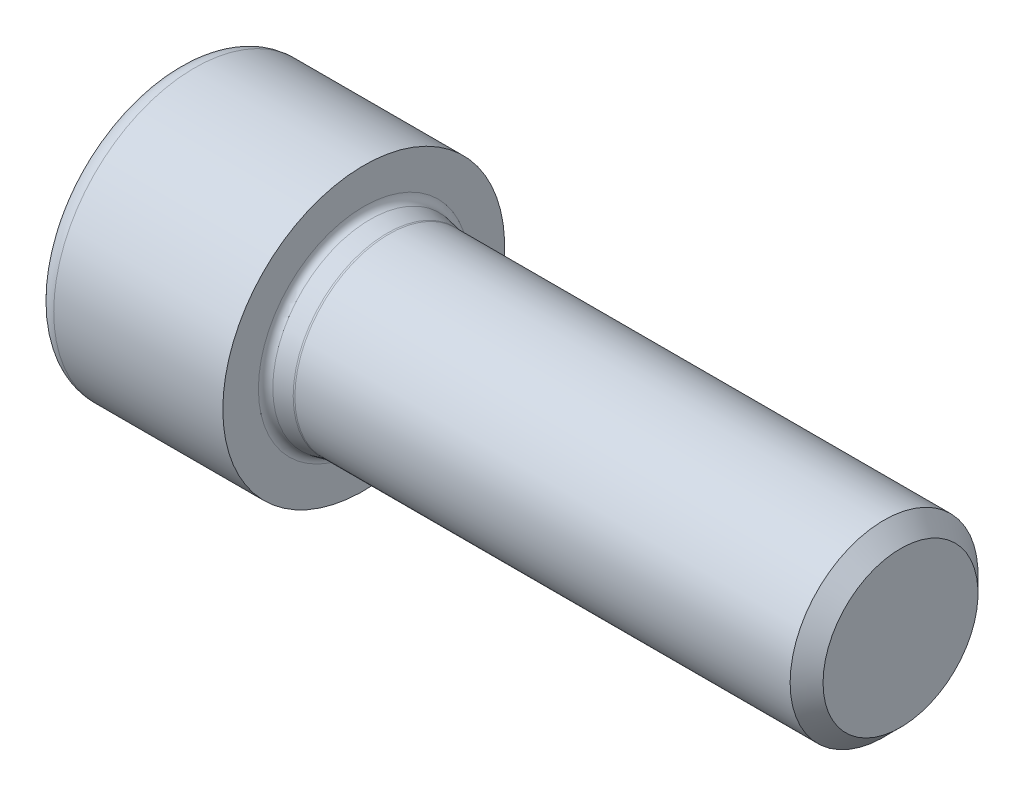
ISO-10303-21;
HEADER;
FILE_DESCRIPTION(('STEP AP214'),'2;1');
FILE_NAME('part.step','',(''),(''),'','','');
FILE_SCHEMA(('AUTOMOTIVE_DESIGN { 1 0 10303 214 1 1 1 1 }'));
ENDSEC;
DATA;
#1=APPLICATION_CONTEXT('core data for automotive mechanical design processes');
#2=APPLICATION_PROTOCOL_DEFINITION('international standard','automotive_design',2000,#1);
#3=PRODUCT_CONTEXT('',#1,'mechanical');
#4=PRODUCT('Part','Part','',(#3));
#5=PRODUCT_RELATED_PRODUCT_CATEGORY('part','',(#4));
#6=PRODUCT_DEFINITION_FORMATION('','',#4);
#7=PRODUCT_DEFINITION_CONTEXT('part definition',#1,'design');
#8=PRODUCT_DEFINITION('design','',#6,#7);
#9=PRODUCT_DEFINITION_SHAPE('','',#8);
#10=(LENGTH_UNIT() NAMED_UNIT(*) SI_UNIT(.MILLI.,.METRE.));
#11=(NAMED_UNIT(*) PLANE_ANGLE_UNIT() SI_UNIT($,.RADIAN.));
#12=(NAMED_UNIT(*) SI_UNIT($,.STERADIAN.) SOLID_ANGLE_UNIT());
#13=UNCERTAINTY_MEASURE_WITH_UNIT(LENGTH_MEASURE(1.E-05),#10,'distance_accuracy_value','');
#14=(GEOMETRIC_REPRESENTATION_CONTEXT(3) GLOBAL_UNCERTAINTY_ASSIGNED_CONTEXT((#13)) GLOBAL_UNIT_ASSIGNED_CONTEXT((#10,
#11,#12)) REPRESENTATION_CONTEXT('',''));
#15=CARTESIAN_POINT('',(0.,0.,0.));
#16=DIRECTION('',(0.,0.,1.));
#17=DIRECTION('',(1.,0.,0.));
#18=AXIS2_PLACEMENT_3D('',#15,#16,#17);
#19=CARTESIAN_POINT('',(-14.,0.,0.));
#20=DIRECTION('',(-1.,0.,0.));
#21=DIRECTION('',(0.,0.,1.));
#22=AXIS2_PLACEMENT_3D('',#19,#20,#21);
#23=CONICAL_SURFACE('',#22,6.86,0.785398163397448);
#24=CARTESIAN_POINT('',(-14.,0.,0.));
#25=DIRECTION('',(-1.,0.,0.));
#26=DIRECTION('',(0.,0.,1.));
#27=AXIS2_PLACEMENT_3D('',#24,#25,#26);
#28=CIRCLE('',#27,6.86);
#29=CARTESIAN_POINT('',(-14.,3.53335357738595,5.88005208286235));
#30=VERTEX_POINT('',#29);
#31=CARTESIAN_POINT('',(-14.,6.85895126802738,0.119947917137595));
#32=VERTEX_POINT('',#31);
#33=EDGE_CURVE('E282',#30,#32,#28,.T.);
#34=ORIENTED_EDGE('',*,*,#33,.T.);
#35=CARTESIAN_POINT('',(-14.0002,6.85915753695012,0.119590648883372));
#36=CARTESIAN_POINT('',(-13.9444024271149,6.80160595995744,0.219272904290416));
#37=CARTESIAN_POINT('',(-13.8903859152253,6.74362198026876,0.319704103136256));
#38=CARTESIAN_POINT('',(-13.7864300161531,6.62671397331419,0.522194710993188));
#39=CARTESIAN_POINT('',(-13.7364927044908,6.567789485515,0.624254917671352));
#40=CARTESIAN_POINT('',(-13.5932008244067,6.389013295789,0.933904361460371));
#41=CARTESIAN_POINT('',(-13.5069097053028,6.26770751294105,1.14401214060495));
#42=CARTESIAN_POINT('',(-13.3595054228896,6.02314041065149,1.56761478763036));
#43=CARTESIAN_POINT('',(-13.2980459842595,5.89993279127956,1.78101664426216));
#44=CARTESIAN_POINT('',(-13.2272474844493,5.71324359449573,2.10437181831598));
#45=CARTESIAN_POINT('',(-13.2072211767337,5.65075562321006,2.21260415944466));
#46=CARTESIAN_POINT('',(-13.1747219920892,5.52529479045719,2.42990869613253));
#47=CARTESIAN_POINT('',(-13.1622481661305,5.46232199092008,2.53898078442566));
#48=CARTESIAN_POINT('',(-13.1410701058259,5.30544059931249,2.81070732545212));
#49=CARTESIAN_POINT('',(-13.1371379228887,5.21135926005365,2.97366098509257));
#50=CARTESIAN_POINT('',(-13.1469976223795,5.02340970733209,3.29919915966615));
#51=CARTESIAN_POINT('',(-13.1607954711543,4.92954157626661,3.4617835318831));
#52=CARTESIAN_POINT('',(-13.2053017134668,4.74273805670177,3.7853367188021));
#53=CARTESIAN_POINT('',(-13.2360262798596,4.64980364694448,3.94630383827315));
#54=CARTESIAN_POINT('',(-13.3127309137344,4.46555140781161,4.26543807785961));
#55=CARTESIAN_POINT('',(-13.358709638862,4.37423343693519,4.42360544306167));
#56=CARTESIAN_POINT('',(-13.4489315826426,4.21917028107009,4.692182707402));
#57=CARTESIAN_POINT('',(-13.4899700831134,4.15494895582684,4.80341730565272));
#58=CARTESIAN_POINT('',(-13.578032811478,4.02754718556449,5.02408364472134));
#59=CARTESIAN_POINT('',(-13.6250566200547,3.96436666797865,5.1335155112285));
#60=CARTESIAN_POINT('',(-13.7241876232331,3.83925390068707,5.35021718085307));
#61=CARTESIAN_POINT('',(-13.7762779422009,3.77731828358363,5.45749281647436));
#62=CARTESIAN_POINT('',(-13.8849961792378,3.65447574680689,5.67026233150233));
#63=CARTESIAN_POINT('',(-13.9416224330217,3.59356845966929,5.77575684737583));
#64=CARTESIAN_POINT('',(-14.0002000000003,3.53314730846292,5.88040935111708));
#65=B_SPLINE_CURVE_WITH_KNOTS('',3,(#35,#36,#37,#38,#39,#40,#41,#42,#43,#44,#45,#46,#47,#48,#49,
#50,#51,#52,#53,#54,#55,#56,#57,#58,#59,#60,#61,#62,#63,#64),.UNSPECIFIED.,.F.,.F.,(4,2,2,2,2,2,
2,2,2,2,2,2,2,2,4),(0.,0.383720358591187,0.767634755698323,1.539127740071,2.29945660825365,
2.67896671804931,3.05842912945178,3.62216130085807,4.18608322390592,4.75054489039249,
5.31495689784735,5.71932747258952,6.12366973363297,6.52670854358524,6.92960014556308),.UNSPECIFIED.);
#66=EDGE_CURVE('E247',#32,#30,#65,.T.);
#67=ORIENTED_EDGE('',*,*,#66,.T.);
#68=EDGE_LOOP('',(#34,#67));
#69=FACE_BOUND('',#68,.T.);
#70=ADVANCED_FACE('F37',(#69),#23,.F.);
#71=CARTESIAN_POINT('',(-14.,6.85895126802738,-0.119947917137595));
#72=VERTEX_POINT('',#71);
#73=CARTESIAN_POINT('',(-14.,3.53335357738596,-5.88005208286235));
#74=VERTEX_POINT('',#73);
#75=EDGE_CURVE('E285',#72,#74,#28,.T.);
#76=ORIENTED_EDGE('',*,*,#75,.T.);
#77=CARTESIAN_POINT('',(-14.0002000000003,3.53314730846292,-5.88040935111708));
#78=CARTESIAN_POINT('',(-13.9444024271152,3.59069888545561,-5.78072709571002));
#79=CARTESIAN_POINT('',(-13.8903859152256,3.6486828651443,-5.68029589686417));
#80=CARTESIAN_POINT('',(-13.7864300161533,3.76559087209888,-5.47780528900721));
#81=CARTESIAN_POINT('',(-13.736492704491,3.82451535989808,-5.37574508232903));
#82=CARTESIAN_POINT('',(-13.5932008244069,4.00329154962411,-5.06609563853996));
#83=CARTESIAN_POINT('',(-13.5069097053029,4.12459733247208,-4.85598785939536));
#84=CARTESIAN_POINT('',(-13.3595054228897,4.36916443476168,-4.43238521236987));
#85=CARTESIAN_POINT('',(-13.2980459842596,4.49237205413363,-4.21898335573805));
#86=CARTESIAN_POINT('',(-13.2272474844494,4.67906125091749,-3.89562818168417));
#87=CARTESIAN_POINT('',(-13.2072211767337,4.74154922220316,-3.78739584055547));
#88=CARTESIAN_POINT('',(-13.1747219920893,4.86701005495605,-3.57009130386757));
#89=CARTESIAN_POINT('',(-13.1622481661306,4.92998285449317,-3.46101921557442));
#90=CARTESIAN_POINT('',(-13.1410701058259,5.08686424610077,-3.18929267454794));
#91=CARTESIAN_POINT('',(-13.1371379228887,5.18094558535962,-3.02633901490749));
#92=CARTESIAN_POINT('',(-13.1469976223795,5.36889513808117,-2.70080084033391));
#93=CARTESIAN_POINT('',(-13.1607954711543,5.46276326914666,-2.53821646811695));
#94=CARTESIAN_POINT('',(-13.2053017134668,5.6495667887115,-2.21466328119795));
#95=CARTESIAN_POINT('',(-13.2360262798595,5.74250119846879,-2.0536961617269));
#96=CARTESIAN_POINT('',(-13.3127309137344,5.92675343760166,-1.73456192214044));
#97=CARTESIAN_POINT('',(-13.358709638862,6.01807140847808,-1.57639455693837));
#98=CARTESIAN_POINT('',(-13.4489315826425,6.17313456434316,-1.30781729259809));
#99=CARTESIAN_POINT('',(-13.4899700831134,6.23735588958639,-1.1965826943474));
#100=CARTESIAN_POINT('',(-13.5780328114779,6.36475765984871,-0.975916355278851));
#101=CARTESIAN_POINT('',(-13.6250566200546,6.42793817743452,-0.866484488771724));
#102=CARTESIAN_POINT('',(-13.724187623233,6.55305094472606,-0.64978281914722));
#103=CARTESIAN_POINT('',(-13.7762779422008,6.61498656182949,-0.542507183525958));
#104=CARTESIAN_POINT('',(-13.8849961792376,6.73782909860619,-0.329737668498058));
#105=CARTESIAN_POINT('',(-13.9416224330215,6.79873638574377,-0.224243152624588));
#106=CARTESIAN_POINT('',(-14.0002,6.85915753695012,-0.119590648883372));
#107=B_SPLINE_CURVE_WITH_KNOTS('',3,(#77,#78,#79,#80,#81,#82,#83,#84,#85,#86,#87,#88,#89,#90,
#91,#92,#93,#94,#95,#96,#97,#98,#99,#100,#101,#102,#103,#104,#105,#106),.UNSPECIFIED.,.F.,.F.,
(4,2,2,2,2,2,2,2,2,2,2,2,2,2,4),(0.,0.38372035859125,0.767634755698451,1.53912774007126,
2.29945660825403,2.67896671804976,3.0584291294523,3.62216130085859,4.18608322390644,
4.75054489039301,5.31495689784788,5.71932747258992,6.12366973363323,6.52670854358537,
6.92960014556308),.UNSPECIFIED.);
#108=EDGE_CURVE('E242',#74,#72,#107,.T.);
#109=ORIENTED_EDGE('',*,*,#108,.T.);
#110=EDGE_LOOP('',(#76,#109));
#111=FACE_BOUND('',#110,.T.);
#112=ADVANCED_FACE('F273',(#111),#23,.F.);
#113=CARTESIAN_POINT('',(-14.,3.32559769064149,-6.));
#114=VERTEX_POINT('',#113);
#115=CARTESIAN_POINT('',(-14.,-3.32559769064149,-6.));
#116=VERTEX_POINT('',#115);
#117=EDGE_CURVE('E291',#114,#116,#28,.T.);
#118=ORIENTED_EDGE('',*,*,#117,.T.);
#119=CARTESIAN_POINT('',(-16.513676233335,-7.20179186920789,-6.));
#120=CARTESIAN_POINT('',(-16.3799465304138,-7.02769341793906,-6.));
#121=CARTESIAN_POINT('',(-16.247422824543,-6.85265377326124,-6.));
#122=CARTESIAN_POINT('',(-15.9853374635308,-6.50030852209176,-6.));
#123=CARTESIAN_POINT('',(-15.8557765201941,-6.32300238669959,-6.));
#124=CARTESIAN_POINT('',(-15.5992446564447,-5.9644445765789,-6.));
#125=CARTESIAN_POINT('',(-15.4723014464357,-5.78317301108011,-6.));
#126=CARTESIAN_POINT('',(-15.2228588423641,-5.41760764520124,-6.));
#127=CARTESIAN_POINT('',(-15.1003591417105,-5.2333140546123,-6.));
#128=CARTESIAN_POINT('',(-14.8532838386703,-4.84950133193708,-6.));
#129=CARTESIAN_POINT('',(-14.7290618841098,-4.64975339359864,-6.));
#130=CARTESIAN_POINT('',(-14.4883660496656,-4.24556859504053,-6.));
#131=CARTESIAN_POINT('',(-14.3718934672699,-4.04113095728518,-6.));
#132=CARTESIAN_POINT('',(-14.1491796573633,-3.62751716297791,-6.));
#133=CARTESIAN_POINT('',(-14.0429083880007,-3.41835731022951,-6.));
#134=CARTESIAN_POINT('',(-13.842978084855,-2.99414194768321,-6.));
#135=CARTESIAN_POINT('',(-13.7493131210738,-2.779089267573,-6.));
#136=CARTESIAN_POINT('',(-13.5863133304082,-2.36384460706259,-6.));
#137=CARTESIAN_POINT('',(-13.5154986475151,-2.16423950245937,-6.));
#138=CARTESIAN_POINT('',(-13.3898488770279,-1.75996744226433,-6.));
#139=CARTESIAN_POINT('',(-13.3350148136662,-1.55530016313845,-6.));
#140=CARTESIAN_POINT('',(-13.245198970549,-1.14567664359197,-6.));
#141=CARTESIAN_POINT('',(-13.2098583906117,-0.940800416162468,-6.));
#142=CARTESIAN_POINT('',(-13.1597627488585,-0.52853253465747,-6.));
#143=CARTESIAN_POINT('',(-13.1450034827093,-0.32114140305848,-6.));
#144=CARTESIAN_POINT('',(-13.1373141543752,0.0851179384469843,-6.));
#145=CARTESIAN_POINT('',(-13.1434725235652,0.283969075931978,-6.));
#146=CARTESIAN_POINT('',(-13.1751919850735,0.680107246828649,-6.));
#147=CARTESIAN_POINT('',(-13.2007548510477,0.877394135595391,-6.));
#148=CARTESIAN_POINT('',(-13.2702767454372,1.2723186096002,-6.));
#149=CARTESIAN_POINT('',(-13.3145595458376,1.46989822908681,-6.));
#150=CARTESIAN_POINT('',(-13.4190727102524,1.86071078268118,-6.));
#151=CARTESIAN_POINT('',(-13.4793021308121,2.05394397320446,-6.));
#152=CARTESIAN_POINT('',(-13.6171183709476,2.44725083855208,-6.));
#153=CARTESIAN_POINT('',(-13.695535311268,2.64703033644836,-6.));
#154=CARTESIAN_POINT('',(-13.8644788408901,3.04144713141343,-6.));
#155=CARTESIAN_POINT('',(-13.9550109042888,3.23608205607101,-6.));
#156=CARTESIAN_POINT('',(-14.1460373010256,3.62113121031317,-6.));
#157=CARTESIAN_POINT('',(-14.2465623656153,3.81153006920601,-6.));
#158=CARTESIAN_POINT('',(-14.4553618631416,4.18796356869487,-6.));
#159=CARTESIAN_POINT('',(-14.5636350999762,4.3739988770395,-6.));
#160=CARTESIAN_POINT('',(-14.7809143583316,4.73317981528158,-6.));
#161=CARTESIAN_POINT('',(-14.8896199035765,4.90650817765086,-6.));
#162=CARTESIAN_POINT('',(-15.1116541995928,5.25018712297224,-6.));
#163=CARTESIAN_POINT('',(-15.22498329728,5.42053748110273,-6.));
#164=CARTESIAN_POINT('',(-15.4545164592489,5.75727951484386,-6.));
#165=CARTESIAN_POINT('',(-15.5706901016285,5.92369200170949,-6.));
#166=CARTESIAN_POINT('',(-15.8061486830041,6.25423460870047,-6.));
#167=CARTESIAN_POINT('',(-15.9254327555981,6.41836534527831,-6.));
#168=CARTESIAN_POINT('',(-16.0459899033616,6.5815390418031,-6.));
#169=B_SPLINE_CURVE_WITH_KNOTS('',3,(#119,#120,#121,#122,#123,#124,#125,#126,#127,#128,#129,
#130,#131,#132,#133,#134,#135,#136,#137,#138,#139,#140,#141,#142,#143,#144,#145,#146,#147,#148,
#149,#150,#151,#152,#153,#154,#155,#156,#157,#158,#159,#160,#161,#162,#163,#164,#165,#166,#167,
#168),.UNSPECIFIED.,.F.,.F.,(4,2,2,2,2,2,2,2,2,2,2,2,2,2,2,2,2,2,2,2,2,2,2,2,4),(0.,
0.658605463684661,1.31736752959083,1.98121434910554,2.64501527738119,3.35054752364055,
4.05619760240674,4.75970139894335,5.46287310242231,6.09770819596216,6.7325839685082,
7.35534699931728,7.97798279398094,8.57383910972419,9.16974989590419,9.77641856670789,
10.3830513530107,11.0264127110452,11.67006575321,12.3157633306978,12.9613614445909,
13.5750641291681,14.1888129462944,14.7976296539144,15.406278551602),.UNSPECIFIED.);
#170=EDGE_CURVE('E236',#116,#114,#169,.T.);
#171=ORIENTED_EDGE('',*,*,#170,.T.);
#172=EDGE_LOOP('',(#118,#171));
#173=FACE_BOUND('',#172,.T.);
#174=ADVANCED_FACE('F278',(#173),#23,.F.);
#175=CARTESIAN_POINT('',(-14.,-3.53335357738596,-5.88005208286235));
#176=VERTEX_POINT('',#175);
#177=CARTESIAN_POINT('',(-14.,-6.85895126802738,-0.119947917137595));
#178=VERTEX_POINT('',#177);
#179=EDGE_CURVE('E298',#176,#178,#28,.T.);
#180=ORIENTED_EDGE('',*,*,#179,.T.);
#181=CARTESIAN_POINT('',(-14.0002,-6.85915753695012,-0.119590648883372));
#182=CARTESIAN_POINT('',(-13.9444024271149,-6.80160595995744,-0.219272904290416));
#183=CARTESIAN_POINT('',(-13.8903859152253,-6.74362198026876,-0.319704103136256));
#184=CARTESIAN_POINT('',(-13.7864300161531,-6.62671397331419,-0.522194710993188));
#185=CARTESIAN_POINT('',(-13.7364927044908,-6.567789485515,-0.624254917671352));
#186=CARTESIAN_POINT('',(-13.5932008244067,-6.389013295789,-0.933904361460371));
#187=CARTESIAN_POINT('',(-13.5069097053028,-6.26770751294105,-1.14401214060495));
#188=CARTESIAN_POINT('',(-13.3595054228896,-6.02314041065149,-1.56761478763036));
#189=CARTESIAN_POINT('',(-13.2980459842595,-5.89993279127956,-1.78101664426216));
#190=CARTESIAN_POINT('',(-13.2272474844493,-5.71324359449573,-2.10437181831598));
#191=CARTESIAN_POINT('',(-13.2072211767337,-5.65075562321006,-2.21260415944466));
#192=CARTESIAN_POINT('',(-13.1747219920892,-5.52529479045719,-2.42990869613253));
#193=CARTESIAN_POINT('',(-13.1622481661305,-5.46232199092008,-2.53898078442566));
#194=CARTESIAN_POINT('',(-13.1410701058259,-5.30544059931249,-2.81070732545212));
#195=CARTESIAN_POINT('',(-13.1371379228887,-5.21135926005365,-2.97366098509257));
#196=CARTESIAN_POINT('',(-13.1469976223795,-5.02340970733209,-3.29919915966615));
#197=CARTESIAN_POINT('',(-13.1607954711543,-4.92954157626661,-3.4617835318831));
#198=CARTESIAN_POINT('',(-13.2053017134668,-4.74273805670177,-3.7853367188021));
#199=CARTESIAN_POINT('',(-13.2360262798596,-4.64980364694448,-3.94630383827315));
#200=CARTESIAN_POINT('',(-13.3127309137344,-4.46555140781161,-4.26543807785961));
#201=CARTESIAN_POINT('',(-13.358709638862,-4.37423343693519,-4.42360544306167));
#202=CARTESIAN_POINT('',(-13.4489315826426,-4.21917028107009,-4.692182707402));
#203=CARTESIAN_POINT('',(-13.4899700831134,-4.15494895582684,-4.80341730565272));
#204=CARTESIAN_POINT('',(-13.578032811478,-4.02754718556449,-5.02408364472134));
#205=CARTESIAN_POINT('',(-13.6250566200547,-3.96436666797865,-5.1335155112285));
#206=CARTESIAN_POINT('',(-13.7241876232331,-3.83925390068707,-5.35021718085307));
#207=CARTESIAN_POINT('',(-13.7762779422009,-3.77731828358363,-5.45749281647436));
#208=CARTESIAN_POINT('',(-13.8849961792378,-3.65447574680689,-5.67026233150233));
#209=CARTESIAN_POINT('',(-13.9416224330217,-3.59356845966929,-5.77575684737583));
#210=CARTESIAN_POINT('',(-14.0002000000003,-3.53314730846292,-5.88040935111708));
#211=B_SPLINE_CURVE_WITH_KNOTS('',3,(#181,#182,#183,#184,#185,#186,#187,#188,#189,#190,#191,
#192,#193,#194,#195,#196,#197,#198,#199,#200,#201,#202,#203,#204,#205,#206,#207,#208,#209,#210),
.UNSPECIFIED.,.F.,.F.,(4,2,2,2,2,2,2,2,2,2,2,2,2,2,4),(0.,0.383720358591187,0.767634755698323,
1.539127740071,2.29945660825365,2.67896671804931,3.05842912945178,3.62216130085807,
4.18608322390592,4.75054489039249,5.31495689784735,5.71932747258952,6.12366973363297,
6.52670854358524,6.92960014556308),.UNSPECIFIED.);
#212=EDGE_CURVE('E230',#178,#176,#211,.T.);
#213=ORIENTED_EDGE('',*,*,#212,.T.);
#214=EDGE_LOOP('',(#180,#213));
#215=FACE_BOUND('',#214,.T.);
#216=ADVANCED_FACE('F465',(#215),#23,.F.);
#217=CARTESIAN_POINT('',(-14.,-6.85895126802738,0.119947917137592));
#218=VERTEX_POINT('',#217);
#219=CARTESIAN_POINT('',(-14.,-3.53335357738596,5.88005208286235));
#220=VERTEX_POINT('',#219);
#221=EDGE_CURVE('E294',#218,#220,#28,.T.);
#222=ORIENTED_EDGE('',*,*,#221,.T.);
#223=CARTESIAN_POINT('',(-14.0002000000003,-3.53314730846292,5.88040935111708));
#224=CARTESIAN_POINT('',(-13.9444024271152,-3.59069888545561,5.78072709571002));
#225=CARTESIAN_POINT('',(-13.8903859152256,-3.6486828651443,5.68029589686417));
#226=CARTESIAN_POINT('',(-13.7864300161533,-3.76559087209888,5.47780528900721));
#227=CARTESIAN_POINT('',(-13.736492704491,-3.82451535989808,5.37574508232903));
#228=CARTESIAN_POINT('',(-13.5932008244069,-4.00329154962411,5.06609563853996));
#229=CARTESIAN_POINT('',(-13.5069097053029,-4.12459733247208,4.85598785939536));
#230=CARTESIAN_POINT('',(-13.3595054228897,-4.36916443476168,4.43238521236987));
#231=CARTESIAN_POINT('',(-13.2980459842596,-4.49237205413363,4.21898335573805));
#232=CARTESIAN_POINT('',(-13.2272474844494,-4.67906125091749,3.89562818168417));
#233=CARTESIAN_POINT('',(-13.2072211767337,-4.74154922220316,3.78739584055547));
#234=CARTESIAN_POINT('',(-13.1747219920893,-4.86701005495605,3.57009130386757));
#235=CARTESIAN_POINT('',(-13.1622481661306,-4.92998285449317,3.46101921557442));
#236=CARTESIAN_POINT('',(-13.1410701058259,-5.08686424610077,3.18929267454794));
#237=CARTESIAN_POINT('',(-13.1371379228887,-5.18094558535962,3.02633901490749));
#238=CARTESIAN_POINT('',(-13.1469976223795,-5.36889513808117,2.70080084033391));
#239=CARTESIAN_POINT('',(-13.1607954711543,-5.46276326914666,2.53821646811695));
#240=CARTESIAN_POINT('',(-13.2053017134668,-5.6495667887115,2.21466328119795));
#241=CARTESIAN_POINT('',(-13.2360262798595,-5.74250119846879,2.0536961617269));
#242=CARTESIAN_POINT('',(-13.3127309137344,-5.92675343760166,1.73456192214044));
#243=CARTESIAN_POINT('',(-13.358709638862,-6.01807140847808,1.57639455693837));
#244=CARTESIAN_POINT('',(-13.4489315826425,-6.17313456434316,1.30781729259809));
#245=CARTESIAN_POINT('',(-13.4899700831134,-6.23735588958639,1.1965826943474));
#246=CARTESIAN_POINT('',(-13.5780328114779,-6.36475765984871,0.975916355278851));
#247=CARTESIAN_POINT('',(-13.6250566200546,-6.42793817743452,0.866484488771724));
#248=CARTESIAN_POINT('',(-13.724187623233,-6.55305094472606,0.64978281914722));
#249=CARTESIAN_POINT('',(-13.7762779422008,-6.61498656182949,0.542507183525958));
#250=CARTESIAN_POINT('',(-13.8849961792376,-6.73782909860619,0.329737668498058));
#251=CARTESIAN_POINT('',(-13.9416224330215,-6.79873638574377,0.224243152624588));
#252=CARTESIAN_POINT('',(-14.0002,-6.85915753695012,0.119590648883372));
#253=B_SPLINE_CURVE_WITH_KNOTS('',3,(#223,#224,#225,#226,#227,#228,#229,#230,#231,#232,#233,
#234,#235,#236,#237,#238,#239,#240,#241,#242,#243,#244,#245,#246,#247,#248,#249,#250,#251,#252),
.UNSPECIFIED.,.F.,.F.,(4,2,2,2,2,2,2,2,2,2,2,2,2,2,4),(0.,0.38372035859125,0.767634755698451,
1.53912774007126,2.29945660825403,2.67896671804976,3.0584291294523,3.62216130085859,
4.18608322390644,4.75054489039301,5.31495689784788,5.71932747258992,6.12366973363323,
6.52670854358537,6.92960014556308),.UNSPECIFIED.);
#254=EDGE_CURVE('E208',#220,#218,#253,.T.);
#255=ORIENTED_EDGE('',*,*,#254,.T.);
#256=EDGE_LOOP('',(#222,#255));
#257=FACE_BOUND('',#256,.T.);
#258=ADVANCED_FACE('F221',(#257),#23,.F.);
#259=CARTESIAN_POINT('',(-14.,-3.32559769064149,6.));
#260=VERTEX_POINT('',#259);
#261=CARTESIAN_POINT('',(-14.,3.32559769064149,6.));
#262=VERTEX_POINT('',#261);
#263=EDGE_CURVE('E287',#260,#262,#28,.T.);
#264=ORIENTED_EDGE('',*,*,#263,.T.);
#265=CARTESIAN_POINT('',(-16.513676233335,-7.20179186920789,6.));
#266=CARTESIAN_POINT('',(-16.3799465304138,-7.02769341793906,6.));
#267=CARTESIAN_POINT('',(-16.247422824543,-6.85265377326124,6.));
#268=CARTESIAN_POINT('',(-15.9853374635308,-6.50030852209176,6.));
#269=CARTESIAN_POINT('',(-15.8557765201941,-6.32300238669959,6.));
#270=CARTESIAN_POINT('',(-15.5992446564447,-5.9644445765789,6.));
#271=CARTESIAN_POINT('',(-15.4723014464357,-5.78317301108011,6.));
#272=CARTESIAN_POINT('',(-15.2228588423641,-5.41760764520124,6.));
#273=CARTESIAN_POINT('',(-15.1003591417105,-5.2333140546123,6.));
#274=CARTESIAN_POINT('',(-14.8532838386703,-4.84950133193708,6.));
#275=CARTESIAN_POINT('',(-14.7290618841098,-4.64975339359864,6.));
#276=CARTESIAN_POINT('',(-14.4883660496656,-4.24556859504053,6.));
#277=CARTESIAN_POINT('',(-14.3718934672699,-4.04113095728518,6.));
#278=CARTESIAN_POINT('',(-14.1491796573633,-3.62751716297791,6.));
#279=CARTESIAN_POINT('',(-14.0429083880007,-3.41835731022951,6.));
#280=CARTESIAN_POINT('',(-13.842978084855,-2.99414194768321,6.));
#281=CARTESIAN_POINT('',(-13.7493131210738,-2.779089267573,6.));
#282=CARTESIAN_POINT('',(-13.5863133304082,-2.36384460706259,6.));
#283=CARTESIAN_POINT('',(-13.5154986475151,-2.16423950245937,6.));
#284=CARTESIAN_POINT('',(-13.3898488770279,-1.75996744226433,6.));
#285=CARTESIAN_POINT('',(-13.3350148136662,-1.55530016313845,6.));
#286=CARTESIAN_POINT('',(-13.245198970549,-1.14567664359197,6.));
#287=CARTESIAN_POINT('',(-13.2098583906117,-0.940800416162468,6.));
#288=CARTESIAN_POINT('',(-13.1597627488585,-0.52853253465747,6.));
#289=CARTESIAN_POINT('',(-13.1450034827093,-0.32114140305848,6.));
#290=CARTESIAN_POINT('',(-13.1373141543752,0.0851179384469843,6.));
#291=CARTESIAN_POINT('',(-13.1434725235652,0.283969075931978,6.));
#292=CARTESIAN_POINT('',(-13.1751919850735,0.680107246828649,6.));
#293=CARTESIAN_POINT('',(-13.2007548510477,0.877394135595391,6.));
#294=CARTESIAN_POINT('',(-13.2702767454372,1.2723186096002,6.));
#295=CARTESIAN_POINT('',(-13.3145595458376,1.46989822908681,6.));
#296=CARTESIAN_POINT('',(-13.4190727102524,1.86071078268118,6.));
#297=CARTESIAN_POINT('',(-13.4793021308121,2.05394397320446,6.));
#298=CARTESIAN_POINT('',(-13.6171183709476,2.44725083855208,6.));
#299=CARTESIAN_POINT('',(-13.695535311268,2.64703033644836,6.));
#300=CARTESIAN_POINT('',(-13.8644788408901,3.04144713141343,6.));
#301=CARTESIAN_POINT('',(-13.9550109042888,3.23608205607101,6.));
#302=CARTESIAN_POINT('',(-14.1460373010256,3.62113121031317,6.));
#303=CARTESIAN_POINT('',(-14.2465623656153,3.81153006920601,6.));
#304=CARTESIAN_POINT('',(-14.4553618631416,4.18796356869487,6.));
#305=CARTESIAN_POINT('',(-14.5636350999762,4.3739988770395,6.));
#306=CARTESIAN_POINT('',(-14.7809143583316,4.73317981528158,6.));
#307=CARTESIAN_POINT('',(-14.8896199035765,4.90650817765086,6.));
#308=CARTESIAN_POINT('',(-15.1116541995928,5.25018712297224,6.));
#309=CARTESIAN_POINT('',(-15.22498329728,5.42053748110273,6.));
#310=CARTESIAN_POINT('',(-15.4545164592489,5.75727951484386,6.));
#311=CARTESIAN_POINT('',(-15.5706901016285,5.92369200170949,6.));
#312=CARTESIAN_POINT('',(-15.8061486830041,6.25423460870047,6.));
#313=CARTESIAN_POINT('',(-15.9254327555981,6.41836534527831,6.));
#314=CARTESIAN_POINT('',(-16.0459899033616,6.5815390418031,6.));
#315=B_SPLINE_CURVE_WITH_KNOTS('',3,(#265,#266,#267,#268,#269,#270,#271,#272,#273,#274,#275,
#276,#277,#278,#279,#280,#281,#282,#283,#284,#285,#286,#287,#288,#289,#290,#291,#292,#293,#294,
#295,#296,#297,#298,#299,#300,#301,#302,#303,#304,#305,#306,#307,#308,#309,#310,#311,#312,#313,
#314),.UNSPECIFIED.,.F.,.F.,(4,2,2,2,2,2,2,2,2,2,2,2,2,2,2,2,2,2,2,2,2,2,2,2,4),(0.,
0.658605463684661,1.31736752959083,1.98121434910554,2.64501527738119,3.35054752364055,
4.05619760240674,4.75970139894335,5.46287310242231,6.09770819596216,6.7325839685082,
7.35534699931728,7.97798279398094,8.57383910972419,9.16974989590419,9.77641856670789,
10.3830513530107,11.0264127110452,11.67006575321,12.3157633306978,12.9613614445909,
13.5750641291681,14.1888129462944,14.7976296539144,15.406278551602),.UNSPECIFIED.);
#316=EDGE_CURVE('E195',#262,#260,#315,.F.);
#317=ORIENTED_EDGE('',*,*,#316,.T.);
#318=EDGE_LOOP('',(#264,#317));
#319=FACE_BOUND('',#318,.T.);
#320=ADVANCED_FACE('F216',(#319),#23,.F.);
#321=CARTESIAN_POINT('',(-14.,0.,-6.86));
#322=DIRECTION('',(1.,0.,0.));
#323=DIRECTION('',(0.,0.,-1.));
#324=AXIS2_PLACEMENT_3D('',#321,#322,#323);
#325=PLANE('',#324);
#326=DIRECTION('',(0.,0.499999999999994,0.866025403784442));
#327=VECTOR('',#326,1.);
#328=CARTESIAN_POINT('',(-14.,2.22568528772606,-8.14500000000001));
#329=LINE('',#328,#327);
#330=CARTESIAN_POINT('',(-14.,6.9282032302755,0.));
#331=VERTEX_POINT('',#330);
#332=EDGE_CURVE('E46',#72,#331,#329,.T.);
#333=ORIENTED_EDGE('',*,*,#332,.T.);
#334=DIRECTION('',(0.,-0.499999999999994,0.866025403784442));
#335=VECTOR('',#334,1.);
#336=CARTESIAN_POINT('',(-14.,8.16661955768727,-2.14500000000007));
#337=LINE('',#336,#335);
#338=EDGE_CURVE('E11',#331,#32,#337,.T.);
#339=ORIENTED_EDGE('',*,*,#338,.T.);
#340=ORIENTED_EDGE('',*,*,#33,.F.);
#341=CARTESIAN_POINT('',(-14.,3.4641016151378,6.));
#342=VERTEX_POINT('',#341);
#343=EDGE_CURVE('E48',#30,#342,#337,.T.);
#344=ORIENTED_EDGE('',*,*,#343,.T.);
#345=DIRECTION('',(0.,-1.,0.));
#346=VECTOR('',#345,1.);
#347=CARTESIAN_POINT('',(-14.,0.,6.));
#348=LINE('',#347,#346);
#349=EDGE_CURVE('E170',#342,#262,#348,.T.);
#350=ORIENTED_EDGE('',*,*,#349,.T.);
#351=ORIENTED_EDGE('',*,*,#263,.F.);
#352=CARTESIAN_POINT('',(-14.,-3.4641016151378,6.));
#353=VERTEX_POINT('',#352);
#354=EDGE_CURVE('E408',#260,#353,#348,.T.);
#355=ORIENTED_EDGE('',*,*,#354,.T.);
#356=DIRECTION('',(0.,-0.499999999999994,-0.866025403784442));
#357=VECTOR('',#356,1.);
#358=CARTESIAN_POINT('',(-14.,-8.16661955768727,-2.14500000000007));
#359=LINE('',#358,#357);
#360=EDGE_CURVE('E405',#353,#220,#359,.T.);
#361=ORIENTED_EDGE('',*,*,#360,.T.);
#362=ORIENTED_EDGE('',*,*,#221,.F.);
#363=CARTESIAN_POINT('',(-14.,-6.9282032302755,0.));
#364=VERTEX_POINT('',#363);
#365=EDGE_CURVE('E403',#218,#364,#359,.T.);
#366=ORIENTED_EDGE('',*,*,#365,.T.);
#367=DIRECTION('',(0.,0.499999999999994,-0.866025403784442));
#368=VECTOR('',#367,1.);
#369=CARTESIAN_POINT('',(-14.,-2.22568528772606,-8.14500000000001));
#370=LINE('',#369,#368);
#371=EDGE_CURVE('E401',#364,#178,#370,.T.);
#372=ORIENTED_EDGE('',*,*,#371,.T.);
#373=ORIENTED_EDGE('',*,*,#179,.F.);
#374=CARTESIAN_POINT('',(-14.,-3.4641016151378,-6.));
#375=VERTEX_POINT('',#374);
#376=EDGE_CURVE('E399',#176,#375,#370,.T.);
#377=ORIENTED_EDGE('',*,*,#376,.T.);
#378=DIRECTION('',(0.,1.,0.));
#379=VECTOR('',#378,1.);
#380=CARTESIAN_POINT('',(-14.,0.,-6.));
#381=LINE('',#380,#379);
#382=EDGE_CURVE('E395',#375,#116,#381,.T.);
#383=ORIENTED_EDGE('',*,*,#382,.T.);
#384=ORIENTED_EDGE('',*,*,#117,.F.);
#385=CARTESIAN_POINT('',(-14.,3.4641016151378,-6.));
#386=VERTEX_POINT('',#385);
#387=EDGE_CURVE('E393',#114,#386,#381,.T.);
#388=ORIENTED_EDGE('',*,*,#387,.T.);
#389=EDGE_CURVE('E41',#386,#74,#329,.T.);
#390=ORIENTED_EDGE('',*,*,#389,.T.);
#391=ORIENTED_EDGE('',*,*,#75,.F.);
#392=EDGE_LOOP('',(#333,#339,#340,#344,#350,#351,#355,#361,#362,#366,#372,#373,#377,#383,#384,
#388,#390,#391));
#393=FACE_BOUND('',#392,.T.);
#394=CARTESIAN_POINT('',(-14.,0.,0.));
#395=DIRECTION('',(-1.,0.,0.));
#396=DIRECTION('',(0.,0.,1.));
#397=AXIS2_PLACEMENT_3D('',#394,#395,#396);
#398=CIRCLE('',#397,9.1);
#399=CARTESIAN_POINT('',(-14.,0.,9.1));
#400=VERTEX_POINT('',#399);
#401=EDGE_CURVE('E295',#400,#400,#398,.T.);
#402=ORIENTED_EDGE('',*,*,#401,.T.);
#403=EDGE_LOOP('',(#402));
#404=FACE_BOUND('',#403,.T.);
#405=ADVANCED_FACE('F220',(#393,#404),#325,.F.);
#406=CARTESIAN_POINT('',(-12.5999999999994,0.,0.));
#407=DIRECTION('',(-1.,0.,0.));
#408=DIRECTION('',(0.,0.,1.));
#409=AXIS2_PLACEMENT_3D('',#406,#407,#408);
#410=TOROIDAL_SURFACE('',#409,9.09999999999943,1.40000000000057);
#411=ORIENTED_EDGE('',*,*,#401,.F.);
#412=EDGE_LOOP('',(#411));
#413=FACE_BOUND('',#412,.T.);
#414=CARTESIAN_POINT('',(-12.6,0.,0.));
#415=DIRECTION('',(-1.,0.,0.));
#416=DIRECTION('',(0.,0.,1.));
#417=AXIS2_PLACEMENT_3D('',#414,#415,#416);
#418=CIRCLE('',#417,10.5);
#419=CARTESIAN_POINT('',(-12.6,0.,10.5));
#420=VERTEX_POINT('',#419);
#421=EDGE_CURVE('E300',#420,#420,#418,.T.);
#422=ORIENTED_EDGE('',*,*,#421,.T.);
#423=EDGE_LOOP('',(#422));
#424=FACE_BOUND('',#423,.T.);
#425=ADVANCED_FACE('F365',(#413,#424),#410,.T.);
#426=CARTESIAN_POINT('',(40.,0.,0.));
#427=DIRECTION('',(-1.,0.,0.));
#428=DIRECTION('',(0.,0.,1.));
#429=AXIS2_PLACEMENT_3D('',#426,#427,#428);
#430=CYLINDRICAL_SURFACE('',#429,10.5);
#431=ORIENTED_EDGE('',*,*,#421,.F.);
#432=EDGE_LOOP('',(#431));
#433=FACE_BOUND('',#432,.T.);
#434=CARTESIAN_POINT('',(0.,0.,0.));
#435=DIRECTION('',(-1.,0.,0.));
#436=DIRECTION('',(0.,0.,1.));
#437=AXIS2_PLACEMENT_3D('',#434,#435,#436);
#438=CIRCLE('',#437,10.5);
#439=CARTESIAN_POINT('',(0.,0.,10.5));
#440=VERTEX_POINT('',#439);
#441=EDGE_CURVE('E304',#440,#440,#438,.T.);
#442=ORIENTED_EDGE('',*,*,#441,.T.);
#443=EDGE_LOOP('',(#442));
#444=FACE_BOUND('',#443,.T.);
#445=ADVANCED_FACE('F362',(#433,#444),#430,.T.);
#446=CARTESIAN_POINT('',(0.,0.,-10.5));
#447=DIRECTION('',(-1.,0.,0.));
#448=DIRECTION('',(0.,0.,1.));
#449=AXIS2_PLACEMENT_3D('',#446,#447,#448);
#450=PLANE('',#449);
#451=ORIENTED_EDGE('',*,*,#441,.F.);
#452=EDGE_LOOP('',(#451));
#453=FACE_BOUND('',#452,.T.);
#454=CARTESIAN_POINT('',(0.,0.,0.));
#455=DIRECTION('',(-1.,0.,0.));
#456=DIRECTION('',(0.,0.,1.));
#457=AXIS2_PLACEMENT_3D('',#454,#455,#456);
#458=CIRCLE('',#457,7.85);
#459=CARTESIAN_POINT('',(0.,0.,7.85));
#460=VERTEX_POINT('',#459);
#461=EDGE_CURVE('E309',#460,#460,#458,.T.);
#462=ORIENTED_EDGE('',*,*,#461,.T.);
#463=EDGE_LOOP('',(#462));
#464=FACE_BOUND('',#463,.T.);
#465=ADVANCED_FACE('F358',(#453,#464),#450,.F.);
#466=CARTESIAN_POINT('',(0.600000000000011,0.,0.));
#467=DIRECTION('',(-1.,0.,0.));
#468=DIRECTION('',(0.,0.,1.));
#469=AXIS2_PLACEMENT_3D('',#466,#467,#468);
#470=TOROIDAL_SURFACE('',#469,7.84999999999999,0.60000000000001);
#471=ORIENTED_EDGE('',*,*,#461,.F.);
#472=EDGE_LOOP('',(#471));
#473=FACE_BOUND('',#472,.T.);
#474=CARTESIAN_POINT('',(0.484113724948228,0.,0.));
#475=DIRECTION('',(-1.,0.,0.));
#476=DIRECTION('',(0.,0.,1.));
#477=AXIS2_PLACEMENT_3D('',#474,#475,#476);
#478=CIRCLE('',#477,7.261297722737);
#479=CARTESIAN_POINT('',(0.484113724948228,0.,7.261297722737));
#480=VERTEX_POINT('',#479);
#481=EDGE_CURVE('E312',#480,#480,#478,.T.);
#482=ORIENTED_EDGE('',*,*,#481,.T.);
#483=EDGE_LOOP('',(#482));
#484=FACE_BOUND('',#483,.T.);
#485=ADVANCED_FACE('F354',(#473,#484),#470,.F.);
#486=CARTESIAN_POINT('',(1.7541137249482,0.,0.));
#487=DIRECTION('',(-1.,0.,0.));
#488=DIRECTION('',(0.,0.,1.));
#489=AXIS2_PLACEMENT_3D('',#486,#487,#488);
#490=CONICAL_SURFACE('',#489,7.011297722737,0.194365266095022);
#491=ORIENTED_EDGE('',*,*,#481,.F.);
#492=EDGE_LOOP('',(#491));
#493=FACE_BOUND('',#492,.T.);
#494=CARTESIAN_POINT('',(1.7541137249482,0.,0.));
#495=DIRECTION('',(-1.,0.,0.));
#496=DIRECTION('',(0.,0.,1.));
#497=AXIS2_PLACEMENT_3D('',#494,#495,#496);
#498=CIRCLE('',#497,7.011297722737);
#499=CARTESIAN_POINT('',(1.7541137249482,0.,7.011297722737));
#500=VERTEX_POINT('',#499);
#501=EDGE_CURVE('E315',#500,#500,#498,.T.);
#502=ORIENTED_EDGE('',*,*,#501,.T.);
#503=EDGE_LOOP('',(#502));
#504=FACE_BOUND('',#503,.T.);
#505=ADVANCED_FACE('F350',(#493,#504),#490,.T.);
#506=CARTESIAN_POINT('',(1.86999999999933,0.,0.));
#507=DIRECTION('',(-1.,0.,0.));
#508=DIRECTION('',(0.,0.,1.));
#509=AXIS2_PLACEMENT_3D('',#506,#507,#508);
#510=TOROIDAL_SURFACE('',#509,7.59999999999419,0.599999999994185);
#511=ORIENTED_EDGE('',*,*,#501,.F.);
#512=EDGE_LOOP('',(#511));
#513=FACE_BOUND('',#512,.T.);
#514=CARTESIAN_POINT('',(1.87,0.,0.));
#515=DIRECTION('',(-1.,0.,0.));
#516=DIRECTION('',(0.,0.,1.));
#517=AXIS2_PLACEMENT_3D('',#514,#515,#516);
#518=CIRCLE('',#517,7.);
#519=CARTESIAN_POINT('',(1.87,0.,7.));
#520=VERTEX_POINT('',#519);
#521=EDGE_CURVE('E318',#520,#520,#518,.T.);
#522=ORIENTED_EDGE('',*,*,#521,.T.);
#523=EDGE_LOOP('',(#522));
#524=FACE_BOUND('',#523,.T.);
#525=ADVANCED_FACE('F346',(#513,#524),#510,.F.);
#526=CARTESIAN_POINT('',(40.,0.,0.));
#527=DIRECTION('',(-1.,0.,0.));
#528=DIRECTION('',(0.,0.,1.));
#529=AXIS2_PLACEMENT_3D('',#526,#527,#528);
#530=CYLINDRICAL_SURFACE('',#529,7.);
#531=ORIENTED_EDGE('',*,*,#521,.F.);
#532=EDGE_LOOP('',(#531));
#533=FACE_BOUND('',#532,.T.);
#534=CARTESIAN_POINT('',(38.773,0.,0.));
#535=DIRECTION('',(-1.,0.,0.));
#536=DIRECTION('',(0.,0.,1.));
#537=AXIS2_PLACEMENT_3D('',#534,#535,#536);
#538=CIRCLE('',#537,7.);
#539=CARTESIAN_POINT('',(38.773,0.,7.));
#540=VERTEX_POINT('',#539);
#541=EDGE_CURVE('E321',#540,#540,#538,.T.);
#542=ORIENTED_EDGE('',*,*,#541,.T.);
#543=EDGE_LOOP('',(#542));
#544=FACE_BOUND('',#543,.T.);
#545=ADVANCED_FACE('F339',(#533,#544),#530,.T.);
#546=CARTESIAN_POINT('',(40.,0.,0.));
#547=DIRECTION('',(-1.,0.,0.));
#548=DIRECTION('',(0.,0.,1.));
#549=AXIS2_PLACEMENT_3D('',#546,#547,#548);
#550=CONICAL_SURFACE('',#549,5.773,0.785398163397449);
#551=ORIENTED_EDGE('',*,*,#541,.F.);
#552=EDGE_LOOP('',(#551));
#553=FACE_BOUND('',#552,.T.);
#554=CARTESIAN_POINT('',(40.,0.,0.));
#555=DIRECTION('',(-1.,0.,0.));
#556=DIRECTION('',(0.,0.,1.));
#557=AXIS2_PLACEMENT_3D('',#554,#555,#556);
#558=CIRCLE('',#557,5.773);
#559=CARTESIAN_POINT('',(40.,0.,5.773));
#560=VERTEX_POINT('',#559);
#561=EDGE_CURVE('E323',#560,#560,#558,.T.);
#562=ORIENTED_EDGE('',*,*,#561,.T.);
#563=EDGE_LOOP('',(#562));
#564=FACE_BOUND('',#563,.T.);
#565=ADVANCED_FACE('F327',(#553,#564),#550,.T.);
#566=CARTESIAN_POINT('',(40.,0.,-5.773));
#567=DIRECTION('',(-1.,0.,0.));
#568=DIRECTION('',(0.,0.,1.));
#569=AXIS2_PLACEMENT_3D('',#566,#567,#568);
#570=PLANE('',#569);
#571=ORIENTED_EDGE('',*,*,#561,.F.);
#572=EDGE_LOOP('',(#571));
#573=FACE_BOUND('',#572,.T.);
#574=ADVANCED_FACE('F329',(#573),#570,.F.);
#575=CARTESIAN_POINT('',(-5.8,3.4641016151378,6.));
#576=DIRECTION('',(1.,0.,0.));
#577=DIRECTION('',(0.,0.,-1.));
#578=AXIS2_PLACEMENT_3D('',#575,#576,#577);
#579=PLANE('',#578);
#580=DIRECTION('',(0.,1.,0.));
#581=VECTOR('',#580,1.);
#582=CARTESIAN_POINT('',(-5.8,-3.4641016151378,-6.));
#583=LINE('',#582,#581);
#584=CARTESIAN_POINT('',(-5.8,-3.4641016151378,-6.));
#585=VERTEX_POINT('',#584);
#586=CARTESIAN_POINT('',(-5.8,0.,-6.));
#587=VERTEX_POINT('',#586);
#588=EDGE_CURVE('E55',#585,#587,#583,.T.);
#589=ORIENTED_EDGE('',*,*,#588,.F.);
#590=DIRECTION('',(0.,0.499999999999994,-0.866025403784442));
#591=VECTOR('',#590,1.);
#592=CARTESIAN_POINT('',(-5.8,-6.9282032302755,0.));
#593=LINE('',#592,#591);
#594=CARTESIAN_POINT('',(-5.8,-5.19615242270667,-2.99999999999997));
#595=VERTEX_POINT('',#594);
#596=EDGE_CURVE('E184',#595,#585,#593,.T.);
#597=ORIENTED_EDGE('',*,*,#596,.F.);
#598=CARTESIAN_POINT('',(-5.8,0.,0.));
#599=DIRECTION('',(-1.,0.,0.));
#600=DIRECTION('',(0.,0.,1.));
#601=AXIS2_PLACEMENT_3D('',#598,#599,#600);
#602=CIRCLE('',#601,6.);
#603=EDGE_CURVE('E415',#587,#595,#602,.T.);
#604=ORIENTED_EDGE('',*,*,#603,.F.);
#605=EDGE_LOOP('',(#589,#597,#604));
#606=FACE_BOUND('',#605,.T.);
#607=ADVANCED_FACE('F258',(#606),#579,.F.);
#608=CARTESIAN_POINT('',(-5.8,-6.9282032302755,0.));
#609=VERTEX_POINT('',#608);
#610=EDGE_CURVE('E185',#609,#595,#593,.T.);
#611=ORIENTED_EDGE('',*,*,#610,.F.);
#612=DIRECTION('',(0.,-0.499999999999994,-0.866025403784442));
#613=VECTOR('',#612,1.);
#614=CARTESIAN_POINT('',(-5.8,-3.4641016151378,6.));
#615=LINE('',#614,#613);
#616=CARTESIAN_POINT('',(-5.8,-5.19615242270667,2.99999999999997));
#617=VERTEX_POINT('',#616);
#618=EDGE_CURVE('E176',#617,#609,#615,.T.);
#619=ORIENTED_EDGE('',*,*,#618,.F.);
#620=EDGE_CURVE('E288',#595,#617,#602,.T.);
#621=ORIENTED_EDGE('',*,*,#620,.F.);
#622=EDGE_LOOP('',(#611,#619,#621));
#623=FACE_BOUND('',#622,.T.);
#624=ADVANCED_FACE('F336',(#623),#579,.F.);
#625=CARTESIAN_POINT('',(-5.8,-3.4641016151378,6.));
#626=VERTEX_POINT('',#625);
#627=EDGE_CURVE('E180',#626,#617,#615,.T.);
#628=ORIENTED_EDGE('',*,*,#627,.F.);
#629=DIRECTION('',(0.,-1.,0.));
#630=VECTOR('',#629,1.);
#631=CARTESIAN_POINT('',(-5.8,3.4641016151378,6.));
#632=LINE('',#631,#630);
#633=CARTESIAN_POINT('',(-5.8,0.,6.));
#634=VERTEX_POINT('',#633);
#635=EDGE_CURVE('E177',#634,#626,#632,.T.);
#636=ORIENTED_EDGE('',*,*,#635,.F.);
#637=EDGE_CURVE('E284',#617,#634,#602,.T.);
#638=ORIENTED_EDGE('',*,*,#637,.F.);
#639=EDGE_LOOP('',(#628,#636,#638));
#640=FACE_BOUND('',#639,.T.);
#641=ADVANCED_FACE('F430',(#640),#579,.F.);
#642=CARTESIAN_POINT('',(-5.8,3.4641016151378,6.));
#643=VERTEX_POINT('',#642);
#644=EDGE_CURVE('E167',#643,#634,#632,.T.);
#645=ORIENTED_EDGE('',*,*,#644,.F.);
#646=DIRECTION('',(0.,-0.499999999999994,0.866025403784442));
#647=VECTOR('',#646,1.);
#648=CARTESIAN_POINT('',(-5.8,6.9282032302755,0.));
#649=LINE('',#648,#647);
#650=CARTESIAN_POINT('',(-5.8,5.19615242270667,2.99999999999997));
#651=VERTEX_POINT('',#650);
#652=EDGE_CURVE('E153',#651,#643,#649,.T.);
#653=ORIENTED_EDGE('',*,*,#652,.F.);
#654=EDGE_CURVE('E174',#634,#651,#602,.T.);
#655=ORIENTED_EDGE('',*,*,#654,.F.);
#656=EDGE_LOOP('',(#645,#653,#655));
#657=FACE_BOUND('',#656,.T.);
#658=ADVANCED_FACE('F173',(#657),#579,.F.);
#659=CARTESIAN_POINT('',(-5.8,6.9282032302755,0.));
#660=VERTEX_POINT('',#659);
#661=EDGE_CURVE('E160',#660,#651,#649,.T.);
#662=ORIENTED_EDGE('',*,*,#661,.F.);
#663=DIRECTION('',(0.,0.499999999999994,0.866025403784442));
#664=VECTOR('',#663,1.);
#665=CARTESIAN_POINT('',(-5.8,3.4641016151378,-6.));
#666=LINE('',#665,#664);
#667=CARTESIAN_POINT('',(-5.8,5.19615242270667,-2.99999999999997));
#668=VERTEX_POINT('',#667);
#669=EDGE_CURVE('E190',#668,#660,#666,.T.);
#670=ORIENTED_EDGE('',*,*,#669,.F.);
#671=EDGE_CURVE('E410',#651,#668,#602,.T.);
#672=ORIENTED_EDGE('',*,*,#671,.F.);
#673=EDGE_LOOP('',(#662,#670,#672));
#674=FACE_BOUND('',#673,.T.);
#675=ADVANCED_FACE('F436',(#674),#579,.F.);
#676=CARTESIAN_POINT('',(-5.8,3.4641016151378,-6.));
#677=VERTEX_POINT('',#676);
#678=EDGE_CURVE('E171',#677,#668,#666,.T.);
#679=ORIENTED_EDGE('',*,*,#678,.F.);
#680=EDGE_CURVE('E188',#587,#677,#583,.T.);
#681=ORIENTED_EDGE('',*,*,#680,.F.);
#682=EDGE_CURVE('E413',#668,#587,#602,.T.);
#683=ORIENTED_EDGE('',*,*,#682,.F.);
#684=EDGE_LOOP('',(#679,#681,#683));
#685=FACE_BOUND('',#684,.T.);
#686=ADVANCED_FACE('F338',(#685),#579,.F.);
#687=CARTESIAN_POINT('',(-19.8,6.9282032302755,0.));
#688=DIRECTION('',(0.,0.866025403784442,0.499999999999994));
#689=DIRECTION('',(0.,-0.499999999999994,0.866025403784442));
#690=AXIS2_PLACEMENT_3D('',#687,#688,#689);
#691=PLANE('',#690);
#692=ORIENTED_EDGE('',*,*,#66,.F.);
#693=ORIENTED_EDGE('',*,*,#338,.F.);
#694=DIRECTION('',(1.,0.,0.));
#695=VECTOR('',#694,1.);
#696=CARTESIAN_POINT('',(-19.8,6.9282032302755,0.));
#697=LINE('',#696,#695);
#698=EDGE_CURVE('E193',#331,#660,#697,.T.);
#699=ORIENTED_EDGE('',*,*,#698,.T.);
#700=ORIENTED_EDGE('',*,*,#661,.T.);
#701=ORIENTED_EDGE('',*,*,#652,.T.);
#702=DIRECTION('',(1.,0.,0.));
#703=VECTOR('',#702,1.);
#704=CARTESIAN_POINT('',(-19.8,3.4641016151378,6.));
#705=LINE('',#704,#703);
#706=EDGE_CURVE('E157',#342,#643,#705,.T.);
#707=ORIENTED_EDGE('',*,*,#706,.F.);
#708=ORIENTED_EDGE('',*,*,#343,.F.);
#709=EDGE_LOOP('',(#692,#693,#699,#700,#701,#707,#708));
#710=FACE_BOUND('',#709,.T.);
#711=ADVANCED_FACE('F155',(#710),#691,.F.);
#712=CARTESIAN_POINT('',(-19.8,3.4641016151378,-6.));
#713=DIRECTION('',(0.,0.866025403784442,-0.499999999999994));
#714=DIRECTION('',(0.,0.499999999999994,0.866025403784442));
#715=AXIS2_PLACEMENT_3D('',#712,#713,#714);
#716=PLANE('',#715);
#717=ORIENTED_EDGE('',*,*,#108,.F.);
#718=ORIENTED_EDGE('',*,*,#389,.F.);
#719=DIRECTION('',(1.,0.,0.));
#720=VECTOR('',#719,1.);
#721=CARTESIAN_POINT('',(-19.8,3.4641016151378,-6.));
#722=LINE('',#721,#720);
#723=EDGE_CURVE('E196',#386,#677,#722,.T.);
#724=ORIENTED_EDGE('',*,*,#723,.T.);
#725=ORIENTED_EDGE('',*,*,#678,.T.);
#726=ORIENTED_EDGE('',*,*,#669,.T.);
#727=ORIENTED_EDGE('',*,*,#698,.F.);
#728=ORIENTED_EDGE('',*,*,#332,.F.);
#729=EDGE_LOOP('',(#717,#718,#724,#725,#726,#727,#728));
#730=FACE_BOUND('',#729,.T.);
#731=ADVANCED_FACE('F252',(#730),#716,.F.);
#732=CARTESIAN_POINT('',(-19.8,-3.4641016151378,-6.));
#733=DIRECTION('',(0.,0.,-1.));
#734=DIRECTION('',(-1.,0.,0.));
#735=AXIS2_PLACEMENT_3D('',#732,#733,#734);
#736=PLANE('',#735);
#737=ORIENTED_EDGE('',*,*,#170,.F.);
#738=ORIENTED_EDGE('',*,*,#382,.F.);
#739=DIRECTION('',(1.,0.,0.));
#740=VECTOR('',#739,1.);
#741=CARTESIAN_POINT('',(-19.8,-3.4641016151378,-6.));
#742=LINE('',#741,#740);
#743=EDGE_CURVE('E198',#375,#585,#742,.T.);
#744=ORIENTED_EDGE('',*,*,#743,.T.);
#745=ORIENTED_EDGE('',*,*,#588,.T.);
#746=ORIENTED_EDGE('',*,*,#680,.T.);
#747=ORIENTED_EDGE('',*,*,#723,.F.);
#748=ORIENTED_EDGE('',*,*,#387,.F.);
#749=EDGE_LOOP('',(#737,#738,#744,#745,#746,#747,#748));
#750=FACE_BOUND('',#749,.T.);
#751=ADVANCED_FACE('F256',(#750),#736,.F.);
#752=CARTESIAN_POINT('',(-19.8,-6.9282032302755,0.));
#753=DIRECTION('',(0.,-0.866025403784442,-0.499999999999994));
#754=DIRECTION('',(0.,0.499999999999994,-0.866025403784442));
#755=AXIS2_PLACEMENT_3D('',#752,#753,#754);
#756=PLANE('',#755);
#757=ORIENTED_EDGE('',*,*,#212,.F.);
#758=ORIENTED_EDGE('',*,*,#371,.F.);
#759=DIRECTION('',(1.,0.,0.));
#760=VECTOR('',#759,1.);
#761=CARTESIAN_POINT('',(-19.8,-6.9282032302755,0.));
#762=LINE('',#761,#760);
#763=EDGE_CURVE('E200',#364,#609,#762,.T.);
#764=ORIENTED_EDGE('',*,*,#763,.T.);
#765=ORIENTED_EDGE('',*,*,#610,.T.);
#766=ORIENTED_EDGE('',*,*,#596,.T.);
#767=ORIENTED_EDGE('',*,*,#743,.F.);
#768=ORIENTED_EDGE('',*,*,#376,.F.);
#769=EDGE_LOOP('',(#757,#758,#764,#765,#766,#767,#768));
#770=FACE_BOUND('',#769,.T.);
#771=ADVANCED_FACE('F261',(#770),#756,.F.);
#772=CARTESIAN_POINT('',(-19.8,-3.4641016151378,6.));
#773=DIRECTION('',(0.,-0.866025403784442,0.499999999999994));
#774=DIRECTION('',(0.,-0.499999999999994,-0.866025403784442));
#775=AXIS2_PLACEMENT_3D('',#772,#773,#774);
#776=PLANE('',#775);
#777=ORIENTED_EDGE('',*,*,#254,.F.);
#778=ORIENTED_EDGE('',*,*,#360,.F.);
#779=DIRECTION('',(1.,0.,0.));
#780=VECTOR('',#779,1.);
#781=CARTESIAN_POINT('',(-19.8,-3.4641016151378,6.));
#782=LINE('',#781,#780);
#783=EDGE_CURVE('E63',#353,#626,#782,.T.);
#784=ORIENTED_EDGE('',*,*,#783,.T.);
#785=ORIENTED_EDGE('',*,*,#627,.T.);
#786=ORIENTED_EDGE('',*,*,#618,.T.);
#787=ORIENTED_EDGE('',*,*,#763,.F.);
#788=ORIENTED_EDGE('',*,*,#365,.F.);
#789=EDGE_LOOP('',(#777,#778,#784,#785,#786,#787,#788));
#790=FACE_BOUND('',#789,.T.);
#791=ADVANCED_FACE('F264',(#790),#776,.F.);
#792=CARTESIAN_POINT('',(-19.8,3.4641016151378,6.));
#793=DIRECTION('',(0.,0.,1.));
#794=DIRECTION('',(1.,0.,0.));
#795=AXIS2_PLACEMENT_3D('',#792,#793,#794);
#796=PLANE('',#795);
#797=ORIENTED_EDGE('',*,*,#316,.F.);
#798=ORIENTED_EDGE('',*,*,#349,.F.);
#799=ORIENTED_EDGE('',*,*,#706,.T.);
#800=ORIENTED_EDGE('',*,*,#644,.T.);
#801=ORIENTED_EDGE('',*,*,#635,.T.);
#802=ORIENTED_EDGE('',*,*,#783,.F.);
#803=ORIENTED_EDGE('',*,*,#354,.F.);
#804=EDGE_LOOP('',(#797,#798,#799,#800,#801,#802,#803));
#805=FACE_BOUND('',#804,.T.);
#806=ADVANCED_FACE('F166',(#805),#796,.F.);
#807=CARTESIAN_POINT('',(-5.8,0.,0.));
#808=DIRECTION('',(-1.,0.,0.));
#809=DIRECTION('',(0.,0.,1.));
#810=AXIS2_PLACEMENT_3D('',#807,#808,#809);
#811=CONICAL_SURFACE('',#810,6.,1.04719755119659);
#812=CARTESIAN_POINT('',(-2.3358983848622,0.,0.));
#813=VERTEX_POINT('',#812);
#814=VERTEX_LOOP('',#813);
#815=FACE_BOUND('',#814,.T.);
#816=ORIENTED_EDGE('',*,*,#654,.T.);
#817=ORIENTED_EDGE('',*,*,#671,.T.);
#818=ORIENTED_EDGE('',*,*,#682,.T.);
#819=ORIENTED_EDGE('',*,*,#603,.T.);
#820=ORIENTED_EDGE('',*,*,#620,.T.);
#821=ORIENTED_EDGE('',*,*,#637,.T.);
#822=EDGE_LOOP('',(#816,#817,#818,#819,#820,#821));
#823=FACE_BOUND('',#822,.T.);
#824=ADVANCED_FACE('F39',(#815,#823),#811,.F.);
#825=CLOSED_SHELL('',(#70,#112,#174,#216,#258,#320,#405,#425,#445,#465,#485,#505,#525,#545,#565,
#574,#607,#624,#641,#658,#675,#686,#711,#731,#751,#771,#791,#806,#824));
#826=MANIFOLD_SOLID_BREP('B2',#825);
#827=ADVANCED_BREP_SHAPE_REPRESENTATION('',(#18,#826),#14);
#828=SHAPE_DEFINITION_REPRESENTATION(#9,#827);
ENDSEC;
END-ISO-10303-21;
